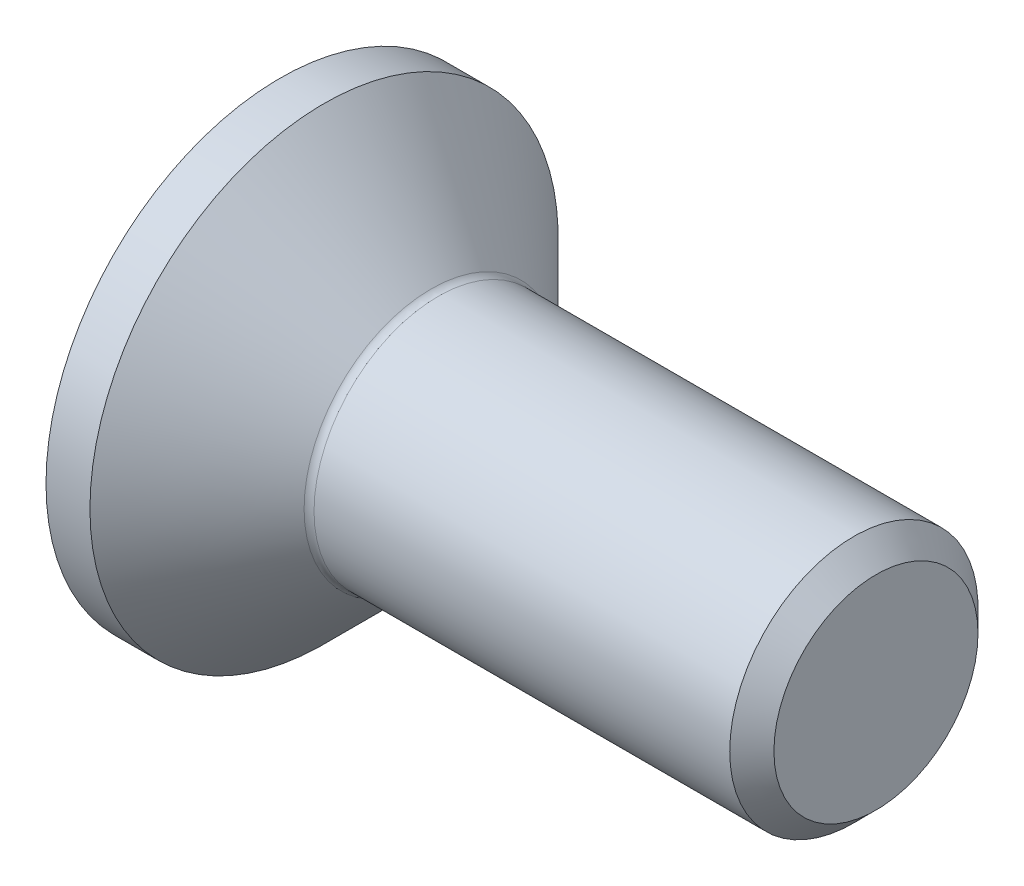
from build123d import *

# Parameters (mm, degrees)
FILLET1_R   = 0.2
HEX_2_DEPTH = 1.9


with BuildPart() as part:
    # BodySke → BaseBody (revolve)
    with BuildSketch(Plane.XY, mode=Mode.PRIVATE) as basebody_sk:
        Polygon((0, 0), (0, 4.715), (0.885, 4.715), (3.1, 2.5), (11.555, 2.5), (12, 2.055), (12, 0), align=None)
    revolve(basebody_sk.sketch.rotate(Axis((0, 0, 0), (1, 0, 0)), 90), axis=Axis((0, 0, 0), (1, 0, 0)))

    # Fillet1
    fillet1_edges = [part.edges().sort_by_distance(p)[0] for p in [
        (3.1, 0, -2.5),
    ]]
    fillet(fillet1_edges, radius=FILLET1_R)

    # Sketch2 → PreBroach (revolve, cut)
    with BuildSketch(Plane.XY, mode=Mode.PRIVATE) as prebroach_sk:
        Polygon((0, 1.5), (1.9, 1.5), (2.766025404, 0), (0, 0), align=None)
    revolve(prebroach_sk.sketch.rotate(Axis((0, 0, 0), (1, 0, 0)), 90), axis=Axis((0, 0, 0), (1, 0, 0)), mode=Mode.SUBTRACT)

    # Sketch3 → Hex 2 (cut)
    with BuildSketch(Plane.ZY):
        Polygon((-1.5, -0.866025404), (-1.5, 0.866025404), (0, 1.732050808), (1.5, 0.866025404), (1.5, -0.866025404), (0, -1.732050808), align=None)
    extrude(amount=-HEX_2_DEPTH, mode=Mode.SUBTRACT)


solid = part.part
